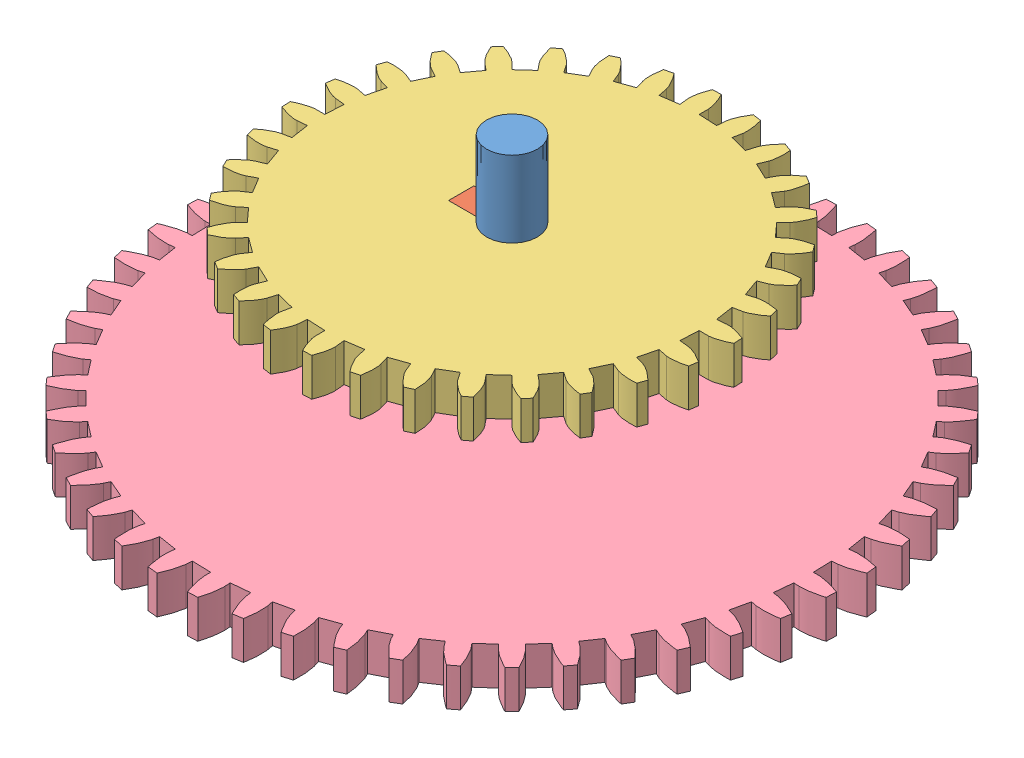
SolidWorks assembly Axle Assembly E Inner.SLDASM, configuration Default (file format 6000). Lengths in mm.
Overall size (26 16.5 26).
5 component instances, 4 part files, 12 mates.
Components (placement in the parent):
- Axle E Inner-1: Axle E Inner.SLDPRT [Default] at (-15.236 6.1239 -2.8568) size (3 16.5 3)
- Key-5: Key.SLDPRT [Default] at (-14.736 12.1239 -2.8568) size (2 1.5 1)
- Key-6: Key.SLDPRT [Default] at (-14.736 18.1239 -2.8568) size (2 1.5 1)
- Gear 32T Axle E Gear 1-1: Gear 32T Axle E Gear 1.sldprt [Default] at (-13.736 18.1239 -2.8568) x (0 0 -1) z (1 0 0) size (16.99 1.5 16.99)
- Gear 50T Axle E Gear 6-1: Gear 50T Axle E Gear 6.sldprt [Default] at (-13.736 12.1239 -2.8568) x (0 0 -1) z (1 0 0) size (26 1.5 26)
Mates (geometry in assembly coordinates):
- Coincident14: coincident anti-aligned: plane of Axle E Inner-1 through (-13.736 12.1239 -2.8568) normal (0 1 0); plane of Key-5 through (-14.736 12.1239 -2.8568) normal (0 -1 0)
- Coincident38: coincident anti-aligned: plane of Axle E Inner-1 through (-13.736 12.1239 -2.3568) normal (0 0 -1); plane of Key-5 through (-15.736 13.6239 -2.3568) normal (0 0 1)
- Coincident40: coincident anti-aligned: plane of Axle E Inner-1 through (-13.736 18.1239 -2.3568) normal (0 0 -1); plane of Key-6 through (-15.736 19.6239 -2.3568) normal (0 0 1)
- Coincident41: coincident anti-aligned: plane of Axle E Inner-1 through (-13.736 6.1239 -2.8568) normal (-1 0 0); plane of Key-6 through (-13.736 19.6239 -2.3568) normal (1 0 0)
- Coincident42: coincident anti-aligned: plane of Axle E Inner-1 through (-13.736 19.6239 -3.3568) normal (0 -1 0); plane of Key-6 through (-14.736 19.6239 -2.8568) normal (0 1 0)
- Coincident43: coincident anti-aligned: plane of Axle E Inner-1 through (-13.736 6.1239 -2.8568) normal (-1 0 0); plane of Key-5 through (-13.736 13.6239 -2.3568) normal (1 0 0)
- Coincident44: coincident aligned: plane of Key-6 through (-14.736 19.6239 -2.8568) normal (0 1 0); plane of Gear 32T Axle E Gear 1-1 through (-11.482 19.6239 7.5163) normal (0 1 0)
- Concentric1: concentric aligned: cylinder of Axle E Inner-1 through (-13.736 22.6239 -2.8568) axis (0 -1 0) radius 1; cylinder of Gear 32T Axle E Gear 1-1 through (-13.736 19.6239 -2.8568) axis (0 -1 0) radius 1
- Coincident45: coincident: line of Key-6 through (-15.736 19.6239 -3.3568) axis (0 0 1); plane of Gear 32T Axle E Gear 1-1 through (-15.736 15.8878 -3.3568) normal (1 0 0)
- Coincident46: coincident aligned: plane of Key-5 through (-14.736 13.6239 -2.8568) normal (0 1 0); plane of Gear 50T Axle E Gear 6-1 through (-9.2277 13.6239 14.5005) normal (0 1 0)
- Concentric2: concentric aligned: cylinder of Axle E Inner-1 through (-13.736 22.6239 -2.8568) axis (0 -1 0) radius 1; cylinder of Gear 50T Axle E Gear 6-1 through (-13.736 13.6239 -2.8568) axis (0 -1 0) radius 1
- Parallel1: parallel aligned: line of Key-5 through (-15.736 13.6239 -3.3568) axis (0 0 1); line of Gear 50T Axle E Gear 6-1 through (-15.736 13.6239 -3.3568) axis (0 0 1)
